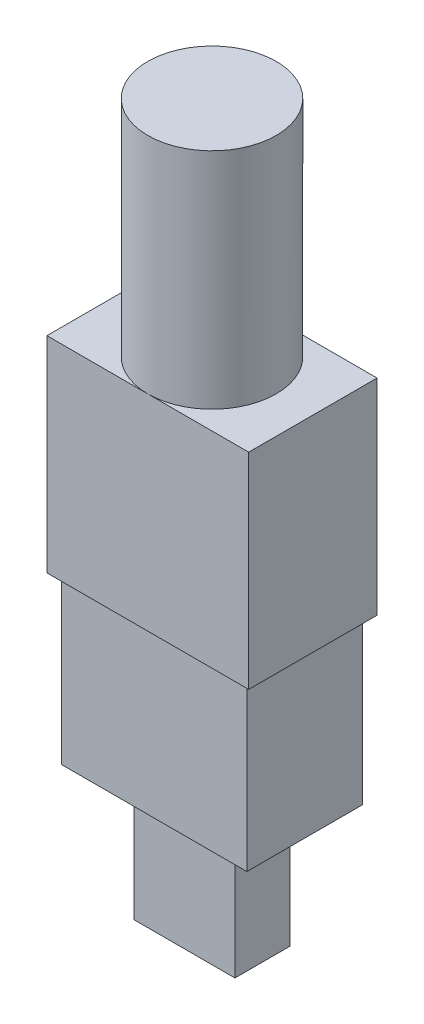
ISO-10303-21;
HEADER;
FILE_DESCRIPTION(('STEP AP214'),'2;1');
FILE_NAME('part.step','',(''),(''),'','','');
FILE_SCHEMA(('AUTOMOTIVE_DESIGN { 1 0 10303 214 1 1 1 1 }'));
ENDSEC;
DATA;
#1=APPLICATION_CONTEXT('core data for automotive mechanical design processes');
#2=APPLICATION_PROTOCOL_DEFINITION('international standard','automotive_design',2000,#1);
#3=PRODUCT_CONTEXT('',#1,'mechanical');
#4=PRODUCT('Part','Part','',(#3));
#5=PRODUCT_RELATED_PRODUCT_CATEGORY('part','',(#4));
#6=PRODUCT_DEFINITION_FORMATION('','',#4);
#7=PRODUCT_DEFINITION_CONTEXT('part definition',#1,'design');
#8=PRODUCT_DEFINITION('design','',#6,#7);
#9=PRODUCT_DEFINITION_SHAPE('','',#8);
#10=(LENGTH_UNIT() NAMED_UNIT(*) SI_UNIT(.MILLI.,.METRE.));
#11=(NAMED_UNIT(*) PLANE_ANGLE_UNIT() SI_UNIT($,.RADIAN.));
#12=(NAMED_UNIT(*) SI_UNIT($,.STERADIAN.) SOLID_ANGLE_UNIT());
#13=UNCERTAINTY_MEASURE_WITH_UNIT(LENGTH_MEASURE(1.E-05),#10,'distance_accuracy_value','');
#14=(GEOMETRIC_REPRESENTATION_CONTEXT(3) GLOBAL_UNCERTAINTY_ASSIGNED_CONTEXT((#13)) GLOBAL_UNIT_ASSIGNED_CONTEXT((#10,
#11,#12)) REPRESENTATION_CONTEXT('',''));
#15=CARTESIAN_POINT('',(0.,0.,0.));
#16=DIRECTION('',(0.,0.,1.));
#17=DIRECTION('',(1.,0.,0.));
#18=AXIS2_PLACEMENT_3D('',#15,#16,#17);
#19=CARTESIAN_POINT('',(0.,27.2,0.));
#20=DIRECTION('',(0.,1.,0.));
#21=DIRECTION('',(0.,0.,1.));
#22=AXIS2_PLACEMENT_3D('',#19,#20,#21);
#23=PLANE('',#22);
#24=CARTESIAN_POINT('',(2.75,27.2,-1.5));
#25=DIRECTION('',(0.,1.,0.));
#26=DIRECTION('',(0.,0.,1.));
#27=AXIS2_PLACEMENT_3D('',#24,#25,#26);
#28=CIRCLE('',#27,3.5);
#29=CARTESIAN_POINT('',(2.75,27.2,2.));
#30=VERTEX_POINT('',#29);
#31=CARTESIAN_POINT('',(2.75,27.2,-5.));
#32=VERTEX_POINT('',#31);
#33=EDGE_CURVE('E43',#30,#32,#28,.T.);
#34=ORIENTED_EDGE('',*,*,#33,.F.);
#35=DIRECTION('',(1.,0.,0.));
#36=VECTOR('',#35,1.);
#37=CARTESIAN_POINT('',(-2.75,27.2,2.));
#38=LINE('',#37,#36);
#39=CARTESIAN_POINT('',(8.25,27.2,2.));
#40=VERTEX_POINT('',#39);
#41=EDGE_CURVE('E146',#30,#40,#38,.T.);
#42=ORIENTED_EDGE('',*,*,#41,.T.);
#43=DIRECTION('',(0.,0.,-1.));
#44=VECTOR('',#43,1.);
#45=CARTESIAN_POINT('',(8.25,27.2,-5.));
#46=LINE('',#45,#44);
#47=CARTESIAN_POINT('',(8.25,27.2,-5.));
#48=VERTEX_POINT('',#47);
#49=EDGE_CURVE('E302',#40,#48,#46,.T.);
#50=ORIENTED_EDGE('',*,*,#49,.T.);
#51=DIRECTION('',(-1.,0.,0.));
#52=VECTOR('',#51,1.);
#53=CARTESIAN_POINT('',(-2.75,27.2,-5.));
#54=LINE('',#53,#52);
#55=EDGE_CURVE('E157',#48,#32,#54,.T.);
#56=ORIENTED_EDGE('',*,*,#55,.T.);
#57=EDGE_LOOP('',(#34,#42,#50,#56));
#58=FACE_BOUND('',#57,.T.);
#59=ADVANCED_FACE('F33',(#58),#23,.T.);
#60=CARTESIAN_POINT('',(0.,7.,0.));
#61=DIRECTION('',(1.,0.,0.));
#62=DIRECTION('',(0.,0.,-1.));
#63=AXIS2_PLACEMENT_3D('',#60,#61,#62);
#64=PLANE('',#63);
#65=DIRECTION('',(0.,0.,1.));
#66=VECTOR('',#65,1.);
#67=CARTESIAN_POINT('',(0.,0.,0.));
#68=LINE('',#67,#66);
#69=CARTESIAN_POINT('',(0.,0.,-3.));
#70=VERTEX_POINT('',#69);
#71=CARTESIAN_POINT('',(0.,0.,0.));
#72=VERTEX_POINT('',#71);
#73=EDGE_CURVE('E237',#70,#72,#68,.T.);
#74=ORIENTED_EDGE('',*,*,#73,.T.);
#75=DIRECTION('',(0.,-1.,0.));
#76=VECTOR('',#75,1.);
#77=CARTESIAN_POINT('',(0.,7.,0.));
#78=LINE('',#77,#76);
#79=CARTESIAN_POINT('',(0.,7.,0.));
#80=VERTEX_POINT('',#79);
#81=EDGE_CURVE('E37',#80,#72,#78,.T.);
#82=ORIENTED_EDGE('',*,*,#81,.F.);
#83=DIRECTION('',(0.,0.,1.));
#84=VECTOR('',#83,1.);
#85=CARTESIAN_POINT('',(0.,7.,0.));
#86=LINE('',#85,#84);
#87=CARTESIAN_POINT('',(0.,7.,-3.));
#88=VERTEX_POINT('',#87);
#89=EDGE_CURVE('E242',#88,#80,#86,.T.);
#90=ORIENTED_EDGE('',*,*,#89,.F.);
#91=DIRECTION('',(0.,-1.,0.));
#92=VECTOR('',#91,1.);
#93=CARTESIAN_POINT('',(0.,7.,-3.));
#94=LINE('',#93,#92);
#95=EDGE_CURVE('E246',#88,#70,#94,.T.);
#96=ORIENTED_EDGE('',*,*,#95,.T.);
#97=EDGE_LOOP('',(#74,#82,#90,#96));
#98=FACE_BOUND('',#97,.T.);
#99=ADVANCED_FACE('F35',(#98),#64,.F.);
#100=CARTESIAN_POINT('',(0.,7.,0.));
#101=DIRECTION('',(0.,0.,-1.));
#102=DIRECTION('',(-1.,0.,0.));
#103=AXIS2_PLACEMENT_3D('',#100,#101,#102);
#104=PLANE('',#103);
#105=DIRECTION('',(1.,0.,0.));
#106=VECTOR('',#105,1.);
#107=CARTESIAN_POINT('',(0.,0.,0.));
#108=LINE('',#107,#106);
#109=CARTESIAN_POINT('',(5.5,0.,0.));
#110=VERTEX_POINT('',#109);
#111=EDGE_CURVE('E230',#72,#110,#108,.T.);
#112=ORIENTED_EDGE('',*,*,#111,.T.);
#113=DIRECTION('',(0.,-1.,0.));
#114=VECTOR('',#113,1.);
#115=CARTESIAN_POINT('',(5.5,7.,0.));
#116=LINE('',#115,#114);
#117=CARTESIAN_POINT('',(5.5,7.,0.));
#118=VERTEX_POINT('',#117);
#119=EDGE_CURVE('E232',#118,#110,#116,.T.);
#120=ORIENTED_EDGE('',*,*,#119,.F.);
#121=DIRECTION('',(1.,0.,0.));
#122=VECTOR('',#121,1.);
#123=CARTESIAN_POINT('',(0.,7.,0.));
#124=LINE('',#123,#122);
#125=EDGE_CURVE('E83',#80,#118,#124,.T.);
#126=ORIENTED_EDGE('',*,*,#125,.F.);
#127=ORIENTED_EDGE('',*,*,#81,.T.);
#128=EDGE_LOOP('',(#112,#120,#126,#127));
#129=FACE_BOUND('',#128,.T.);
#130=ADVANCED_FACE('F177',(#129),#104,.F.);
#131=CARTESIAN_POINT('',(5.5,7.,0.));
#132=DIRECTION('',(-1.,0.,0.));
#133=DIRECTION('',(0.,0.,1.));
#134=AXIS2_PLACEMENT_3D('',#131,#132,#133);
#135=PLANE('',#134);
#136=DIRECTION('',(0.,0.,-1.));
#137=VECTOR('',#136,1.);
#138=CARTESIAN_POINT('',(5.5,0.,0.));
#139=LINE('',#138,#137);
#140=CARTESIAN_POINT('',(5.5,0.,-3.));
#141=VERTEX_POINT('',#140);
#142=EDGE_CURVE('E236',#110,#141,#139,.T.);
#143=ORIENTED_EDGE('',*,*,#142,.T.);
#144=DIRECTION('',(0.,-1.,0.));
#145=VECTOR('',#144,1.);
#146=CARTESIAN_POINT('',(5.5,7.,-3.));
#147=LINE('',#146,#145);
#148=CARTESIAN_POINT('',(5.5,7.,-3.));
#149=VERTEX_POINT('',#148);
#150=EDGE_CURVE('E57',#149,#141,#147,.T.);
#151=ORIENTED_EDGE('',*,*,#150,.F.);
#152=DIRECTION('',(0.,0.,-1.));
#153=VECTOR('',#152,1.);
#154=CARTESIAN_POINT('',(5.5,7.,0.));
#155=LINE('',#154,#153);
#156=EDGE_CURVE('E240',#118,#149,#155,.T.);
#157=ORIENTED_EDGE('',*,*,#156,.F.);
#158=ORIENTED_EDGE('',*,*,#119,.T.);
#159=EDGE_LOOP('',(#143,#151,#157,#158));
#160=FACE_BOUND('',#159,.T.);
#161=ADVANCED_FACE('F225',(#160),#135,.F.);
#162=CARTESIAN_POINT('',(0.,7.,-3.));
#163=DIRECTION('',(0.,0.,1.));
#164=DIRECTION('',(1.,0.,0.));
#165=AXIS2_PLACEMENT_3D('',#162,#163,#164);
#166=PLANE('',#165);
#167=DIRECTION('',(-1.,0.,0.));
#168=VECTOR('',#167,1.);
#169=CARTESIAN_POINT('',(0.,0.,-3.));
#170=LINE('',#169,#168);
#171=EDGE_CURVE('E77',#141,#70,#170,.T.);
#172=ORIENTED_EDGE('',*,*,#171,.T.);
#173=ORIENTED_EDGE('',*,*,#95,.F.);
#174=DIRECTION('',(-1.,0.,0.));
#175=VECTOR('',#174,1.);
#176=CARTESIAN_POINT('',(0.,7.,-3.));
#177=LINE('',#176,#175);
#178=EDGE_CURVE('E248',#149,#88,#177,.T.);
#179=ORIENTED_EDGE('',*,*,#178,.F.);
#180=ORIENTED_EDGE('',*,*,#150,.T.);
#181=EDGE_LOOP('',(#172,#173,#179,#180));
#182=FACE_BOUND('',#181,.T.);
#183=ADVANCED_FACE('F221',(#182),#166,.F.);
#184=CARTESIAN_POINT('',(0.,0.,0.));
#185=DIRECTION('',(0.,-1.,0.));
#186=DIRECTION('',(0.,0.,-1.));
#187=AXIS2_PLACEMENT_3D('',#184,#185,#186);
#188=PLANE('',#187);
#189=ORIENTED_EDGE('',*,*,#73,.F.);
#190=ORIENTED_EDGE('',*,*,#171,.F.);
#191=ORIENTED_EDGE('',*,*,#142,.F.);
#192=ORIENTED_EDGE('',*,*,#111,.F.);
#193=EDGE_LOOP('',(#189,#190,#191,#192));
#194=FACE_BOUND('',#193,.T.);
#195=ADVANCED_FACE('F203',(#194),#188,.T.);
#196=CARTESIAN_POINT('',(0.,7.,0.));
#197=DIRECTION('',(0.,1.,0.));
#198=DIRECTION('',(0.,0.,1.));
#199=AXIS2_PLACEMENT_3D('',#196,#197,#198);
#200=PLANE('',#199);
#201=DIRECTION('',(0.,0.,-1.));
#202=VECTOR('',#201,1.);
#203=CARTESIAN_POINT('',(7.8,7.,-4.65));
#204=LINE('',#203,#202);
#205=CARTESIAN_POINT('',(7.8,7.,1.65));
#206=VERTEX_POINT('',#205);
#207=CARTESIAN_POINT('',(7.8,7.,-4.65));
#208=VERTEX_POINT('',#207);
#209=EDGE_CURVE('E279',#206,#208,#204,.T.);
#210=ORIENTED_EDGE('',*,*,#209,.F.);
#211=DIRECTION('',(1.,0.,0.));
#212=VECTOR('',#211,1.);
#213=CARTESIAN_POINT('',(-2.3,7.,1.65));
#214=LINE('',#213,#212);
#215=CARTESIAN_POINT('',(-2.3,7.,1.65));
#216=VERTEX_POINT('',#215);
#217=EDGE_CURVE('E272',#216,#206,#214,.T.);
#218=ORIENTED_EDGE('',*,*,#217,.F.);
#219=DIRECTION('',(0.,0.,1.));
#220=VECTOR('',#219,1.);
#221=CARTESIAN_POINT('',(-2.3,7.,-4.65));
#222=LINE('',#221,#220);
#223=CARTESIAN_POINT('',(-2.3,7.,-4.65));
#224=VERTEX_POINT('',#223);
#225=EDGE_CURVE('E275',#224,#216,#222,.T.);
#226=ORIENTED_EDGE('',*,*,#225,.F.);
#227=DIRECTION('',(-1.,0.,0.));
#228=VECTOR('',#227,1.);
#229=CARTESIAN_POINT('',(-2.3,7.,-4.65));
#230=LINE('',#229,#228);
#231=EDGE_CURVE('E277',#208,#224,#230,.T.);
#232=ORIENTED_EDGE('',*,*,#231,.F.);
#233=EDGE_LOOP('',(#210,#218,#226,#232));
#234=FACE_BOUND('',#233,.T.);
#235=ORIENTED_EDGE('',*,*,#178,.T.);
#236=ORIENTED_EDGE('',*,*,#89,.T.);
#237=ORIENTED_EDGE('',*,*,#125,.T.);
#238=ORIENTED_EDGE('',*,*,#156,.T.);
#239=EDGE_LOOP('',(#235,#236,#237,#238));
#240=FACE_BOUND('',#239,.T.);
#241=ADVANCED_FACE('F199',(#234,#240),#200,.F.);
#242=CARTESIAN_POINT('',(7.8,16.,-4.65));
#243=DIRECTION('',(-1.,0.,0.));
#244=DIRECTION('',(0.,0.,1.));
#245=AXIS2_PLACEMENT_3D('',#242,#243,#244);
#246=PLANE('',#245);
#247=ORIENTED_EDGE('',*,*,#209,.T.);
#248=DIRECTION('',(0.,-1.,0.));
#249=VECTOR('',#248,1.);
#250=CARTESIAN_POINT('',(7.8,16.,-4.65));
#251=LINE('',#250,#249);
#252=CARTESIAN_POINT('',(7.8,16.,-4.65));
#253=VERTEX_POINT('',#252);
#254=EDGE_CURVE('E256',#253,#208,#251,.T.);
#255=ORIENTED_EDGE('',*,*,#254,.F.);
#256=DIRECTION('',(0.,0.,-1.));
#257=VECTOR('',#256,1.);
#258=CARTESIAN_POINT('',(7.8,16.,-4.65));
#259=LINE('',#258,#257);
#260=CARTESIAN_POINT('',(7.8,16.,1.65));
#261=VERTEX_POINT('',#260);
#262=EDGE_CURVE('E274',#261,#253,#259,.T.);
#263=ORIENTED_EDGE('',*,*,#262,.F.);
#264=DIRECTION('',(0.,-1.,0.));
#265=VECTOR('',#264,1.);
#266=CARTESIAN_POINT('',(7.8,16.,1.65));
#267=LINE('',#266,#265);
#268=EDGE_CURVE('E268',#261,#206,#267,.T.);
#269=ORIENTED_EDGE('',*,*,#268,.T.);
#270=EDGE_LOOP('',(#247,#255,#263,#269));
#271=FACE_BOUND('',#270,.T.);
#272=ADVANCED_FACE('F202',(#271),#246,.F.);
#273=CARTESIAN_POINT('',(-2.3,16.,-4.65));
#274=DIRECTION('',(0.,0.,1.));
#275=DIRECTION('',(1.,0.,0.));
#276=AXIS2_PLACEMENT_3D('',#273,#274,#275);
#277=PLANE('',#276);
#278=ORIENTED_EDGE('',*,*,#231,.T.);
#279=DIRECTION('',(0.,-1.,0.));
#280=VECTOR('',#279,1.);
#281=CARTESIAN_POINT('',(-2.3,16.,-4.65));
#282=LINE('',#281,#280);
#283=CARTESIAN_POINT('',(-2.3,16.,-4.65));
#284=VERTEX_POINT('',#283);
#285=EDGE_CURVE('E258',#284,#224,#282,.T.);
#286=ORIENTED_EDGE('',*,*,#285,.F.);
#287=DIRECTION('',(-1.,0.,0.));
#288=VECTOR('',#287,1.);
#289=CARTESIAN_POINT('',(-2.3,16.,-4.65));
#290=LINE('',#289,#288);
#291=EDGE_CURVE('E287',#253,#284,#290,.T.);
#292=ORIENTED_EDGE('',*,*,#291,.F.);
#293=ORIENTED_EDGE('',*,*,#254,.T.);
#294=EDGE_LOOP('',(#278,#286,#292,#293));
#295=FACE_BOUND('',#294,.T.);
#296=ADVANCED_FACE('F211',(#295),#277,.F.);
#297=CARTESIAN_POINT('',(-2.3,16.,-4.65));
#298=DIRECTION('',(1.,0.,0.));
#299=DIRECTION('',(0.,0.,-1.));
#300=AXIS2_PLACEMENT_3D('',#297,#298,#299);
#301=PLANE('',#300);
#302=ORIENTED_EDGE('',*,*,#225,.T.);
#303=DIRECTION('',(0.,-1.,0.));
#304=VECTOR('',#303,1.);
#305=CARTESIAN_POINT('',(-2.3,16.,1.65));
#306=LINE('',#305,#304);
#307=CARTESIAN_POINT('',(-2.3,16.,1.65));
#308=VERTEX_POINT('',#307);
#309=EDGE_CURVE('E263',#308,#216,#306,.T.);
#310=ORIENTED_EDGE('',*,*,#309,.F.);
#311=DIRECTION('',(0.,0.,1.));
#312=VECTOR('',#311,1.);
#313=CARTESIAN_POINT('',(-2.3,16.,-4.65));
#314=LINE('',#313,#312);
#315=EDGE_CURVE('E284',#284,#308,#314,.T.);
#316=ORIENTED_EDGE('',*,*,#315,.F.);
#317=ORIENTED_EDGE('',*,*,#285,.T.);
#318=EDGE_LOOP('',(#302,#310,#316,#317));
#319=FACE_BOUND('',#318,.T.);
#320=ADVANCED_FACE('F207',(#319),#301,.F.);
#321=CARTESIAN_POINT('',(-2.3,16.,1.65));
#322=DIRECTION('',(0.,0.,-1.));
#323=DIRECTION('',(-1.,0.,0.));
#324=AXIS2_PLACEMENT_3D('',#321,#322,#323);
#325=PLANE('',#324);
#326=ORIENTED_EDGE('',*,*,#217,.T.);
#327=ORIENTED_EDGE('',*,*,#268,.F.);
#328=DIRECTION('',(1.,0.,0.));
#329=VECTOR('',#328,1.);
#330=CARTESIAN_POINT('',(-2.3,16.,1.65));
#331=LINE('',#330,#329);
#332=EDGE_CURVE('E271',#308,#261,#331,.T.);
#333=ORIENTED_EDGE('',*,*,#332,.F.);
#334=ORIENTED_EDGE('',*,*,#309,.T.);
#335=EDGE_LOOP('',(#326,#327,#333,#334));
#336=FACE_BOUND('',#335,.T.);
#337=ADVANCED_FACE('F184',(#336),#325,.F.);
#338=CARTESIAN_POINT('',(0.,16.,0.));
#339=DIRECTION('',(0.,1.,0.));
#340=DIRECTION('',(0.,0.,1.));
#341=AXIS2_PLACEMENT_3D('',#338,#339,#340);
#342=PLANE('',#341);
#343=DIRECTION('',(0.,0.,-1.));
#344=VECTOR('',#343,1.);
#345=CARTESIAN_POINT('',(8.25,16.,-5.));
#346=LINE('',#345,#344);
#347=CARTESIAN_POINT('',(8.25,16.,2.));
#348=VERTEX_POINT('',#347);
#349=CARTESIAN_POINT('',(8.25,16.,-5.));
#350=VERTEX_POINT('',#349);
#351=EDGE_CURVE('E307',#348,#350,#346,.T.);
#352=ORIENTED_EDGE('',*,*,#351,.F.);
#353=DIRECTION('',(1.,0.,0.));
#354=VECTOR('',#353,1.);
#355=CARTESIAN_POINT('',(-2.75,16.,2.));
#356=LINE('',#355,#354);
#357=CARTESIAN_POINT('',(-2.75,16.,2.));
#358=VERTEX_POINT('',#357);
#359=EDGE_CURVE('E300',#358,#348,#356,.T.);
#360=ORIENTED_EDGE('',*,*,#359,.F.);
#361=DIRECTION('',(0.,0.,1.));
#362=VECTOR('',#361,1.);
#363=CARTESIAN_POINT('',(-2.75,16.,-5.));
#364=LINE('',#363,#362);
#365=CARTESIAN_POINT('',(-2.75,16.,-5.));
#366=VERTEX_POINT('',#365);
#367=EDGE_CURVE('E303',#366,#358,#364,.T.);
#368=ORIENTED_EDGE('',*,*,#367,.F.);
#369=DIRECTION('',(-1.,0.,0.));
#370=VECTOR('',#369,1.);
#371=CARTESIAN_POINT('',(-2.75,16.,-5.));
#372=LINE('',#371,#370);
#373=EDGE_CURVE('E305',#350,#366,#372,.T.);
#374=ORIENTED_EDGE('',*,*,#373,.F.);
#375=EDGE_LOOP('',(#352,#360,#368,#374));
#376=FACE_BOUND('',#375,.T.);
#377=ORIENTED_EDGE('',*,*,#332,.T.);
#378=ORIENTED_EDGE('',*,*,#262,.T.);
#379=ORIENTED_EDGE('',*,*,#291,.T.);
#380=ORIENTED_EDGE('',*,*,#315,.T.);
#381=EDGE_LOOP('',(#377,#378,#379,#380));
#382=FACE_BOUND('',#381,.T.);
#383=ADVANCED_FACE('F180',(#376,#382),#342,.F.);
#384=CARTESIAN_POINT('',(8.25,27.2,-5.));
#385=DIRECTION('',(-1.,0.,0.));
#386=DIRECTION('',(0.,0.,1.));
#387=AXIS2_PLACEMENT_3D('',#384,#385,#386);
#388=PLANE('',#387);
#389=ORIENTED_EDGE('',*,*,#351,.T.);
#390=DIRECTION('',(0.,-1.,0.));
#391=VECTOR('',#390,1.);
#392=CARTESIAN_POINT('',(8.25,27.2,-5.));
#393=LINE('',#392,#391);
#394=EDGE_CURVE('E281',#48,#350,#393,.T.);
#395=ORIENTED_EDGE('',*,*,#394,.F.);
#396=ORIENTED_EDGE('',*,*,#49,.F.);
#397=DIRECTION('',(0.,-1.,0.));
#398=VECTOR('',#397,1.);
#399=CARTESIAN_POINT('',(8.25,27.2,2.));
#400=LINE('',#399,#398);
#401=EDGE_CURVE('E145',#40,#348,#400,.T.);
#402=ORIENTED_EDGE('',*,*,#401,.T.);
#403=EDGE_LOOP('',(#389,#395,#396,#402));
#404=FACE_BOUND('',#403,.T.);
#405=ADVANCED_FACE('F183',(#404),#388,.F.);
#406=CARTESIAN_POINT('',(-2.75,27.2,-5.));
#407=DIRECTION('',(0.,0.,1.));
#408=DIRECTION('',(1.,0.,0.));
#409=AXIS2_PLACEMENT_3D('',#406,#407,#408);
#410=PLANE('',#409);
#411=ORIENTED_EDGE('',*,*,#373,.T.);
#412=DIRECTION('',(0.,-1.,0.));
#413=VECTOR('',#412,1.);
#414=CARTESIAN_POINT('',(-2.75,27.2,-5.));
#415=LINE('',#414,#413);
#416=CARTESIAN_POINT('',(-2.75,27.2,-5.));
#417=VERTEX_POINT('',#416);
#418=EDGE_CURVE('E294',#417,#366,#415,.T.);
#419=ORIENTED_EDGE('',*,*,#418,.F.);
#420=EDGE_CURVE('E312',#32,#417,#54,.T.);
#421=ORIENTED_EDGE('',*,*,#420,.F.);
#422=ORIENTED_EDGE('',*,*,#55,.F.);
#423=ORIENTED_EDGE('',*,*,#394,.T.);
#424=EDGE_LOOP('',(#411,#419,#421,#422,#423));
#425=FACE_BOUND('',#424,.T.);
#426=ADVANCED_FACE('F191',(#425),#410,.F.);
#427=CARTESIAN_POINT('',(-2.75,27.2,-5.));
#428=DIRECTION('',(1.,0.,0.));
#429=DIRECTION('',(0.,0.,-1.));
#430=AXIS2_PLACEMENT_3D('',#427,#428,#429);
#431=PLANE('',#430);
#432=ORIENTED_EDGE('',*,*,#367,.T.);
#433=DIRECTION('',(0.,-1.,0.));
#434=VECTOR('',#433,1.);
#435=CARTESIAN_POINT('',(-2.75,27.2,2.));
#436=LINE('',#435,#434);
#437=CARTESIAN_POINT('',(-2.75,27.2,2.));
#438=VERTEX_POINT('',#437);
#439=EDGE_CURVE('E297',#438,#358,#436,.T.);
#440=ORIENTED_EDGE('',*,*,#439,.F.);
#441=DIRECTION('',(0.,0.,1.));
#442=VECTOR('',#441,1.);
#443=CARTESIAN_POINT('',(-2.75,27.2,-5.));
#444=LINE('',#443,#442);
#445=EDGE_CURVE('E141',#417,#438,#444,.T.);
#446=ORIENTED_EDGE('',*,*,#445,.F.);
#447=ORIENTED_EDGE('',*,*,#418,.T.);
#448=EDGE_LOOP('',(#432,#440,#446,#447));
#449=FACE_BOUND('',#448,.T.);
#450=ADVANCED_FACE('F188',(#449),#431,.F.);
#451=CARTESIAN_POINT('',(-2.75,27.2,2.));
#452=DIRECTION('',(0.,0.,-1.));
#453=DIRECTION('',(-1.,0.,0.));
#454=AXIS2_PLACEMENT_3D('',#451,#452,#453);
#455=PLANE('',#454);
#456=ORIENTED_EDGE('',*,*,#359,.T.);
#457=ORIENTED_EDGE('',*,*,#401,.F.);
#458=ORIENTED_EDGE('',*,*,#41,.F.);
#459=EDGE_CURVE('E137',#438,#30,#38,.T.);
#460=ORIENTED_EDGE('',*,*,#459,.F.);
#461=ORIENTED_EDGE('',*,*,#439,.T.);
#462=EDGE_LOOP('',(#456,#457,#458,#460,#461));
#463=FACE_BOUND('',#462,.T.);
#464=ADVANCED_FACE('F150',(#463),#455,.F.);
#465=EDGE_CURVE('E11',#32,#30,#28,.T.);
#466=ORIENTED_EDGE('',*,*,#465,.F.);
#467=ORIENTED_EDGE('',*,*,#420,.T.);
#468=ORIENTED_EDGE('',*,*,#445,.T.);
#469=ORIENTED_EDGE('',*,*,#459,.T.);
#470=EDGE_LOOP('',(#466,#467,#468,#469));
#471=FACE_BOUND('',#470,.T.);
#472=ADVANCED_FACE('F139',(#471),#23,.T.);
#473=CARTESIAN_POINT('',(2.75,39.4,-1.5));
#474=DIRECTION('',(0.,-1.,0.));
#475=DIRECTION('',(0.,0.,-1.));
#476=AXIS2_PLACEMENT_3D('',#473,#474,#475);
#477=CYLINDRICAL_SURFACE('',#476,3.5);
#478=CARTESIAN_POINT('',(2.75,39.4,-1.5));
#479=DIRECTION('',(0.,1.,0.));
#480=DIRECTION('',(0.,0.,1.));
#481=AXIS2_PLACEMENT_3D('',#478,#479,#480);
#482=CIRCLE('',#481,3.5);
#483=CARTESIAN_POINT('',(2.75,39.4,2.));
#484=VERTEX_POINT('',#483);
#485=EDGE_CURVE('E159',#484,#484,#482,.T.);
#486=ORIENTED_EDGE('',*,*,#485,.F.);
#487=EDGE_LOOP('',(#486));
#488=FACE_BOUND('',#487,.T.);
#489=ORIENTED_EDGE('',*,*,#33,.T.);
#490=ORIENTED_EDGE('',*,*,#465,.T.);
#491=EDGE_LOOP('',(#489,#490));
#492=FACE_BOUND('',#491,.T.);
#493=ADVANCED_FACE('F160',(#488,#492),#477,.T.);
#494=CARTESIAN_POINT('',(2.75,39.4,-1.5));
#495=DIRECTION('',(0.,1.,0.));
#496=DIRECTION('',(0.,0.,1.));
#497=AXIS2_PLACEMENT_3D('',#494,#495,#496);
#498=PLANE('',#497);
#499=ORIENTED_EDGE('',*,*,#485,.T.);
#500=EDGE_LOOP('',(#499));
#501=FACE_BOUND('',#500,.T.);
#502=ADVANCED_FACE('F162',(#501),#498,.T.);
#503=CLOSED_SHELL('',(#59,#99,#130,#161,#183,#195,#241,#272,#296,#320,#337,#383,#405,#426,#450,
#464,#472,#493,#502));
#504=MANIFOLD_SOLID_BREP('B2',#503);
#505=ADVANCED_BREP_SHAPE_REPRESENTATION('',(#18,#504),#14);
#506=SHAPE_DEFINITION_REPRESENTATION(#9,#505);
ENDSEC;
END-ISO-10303-21;
